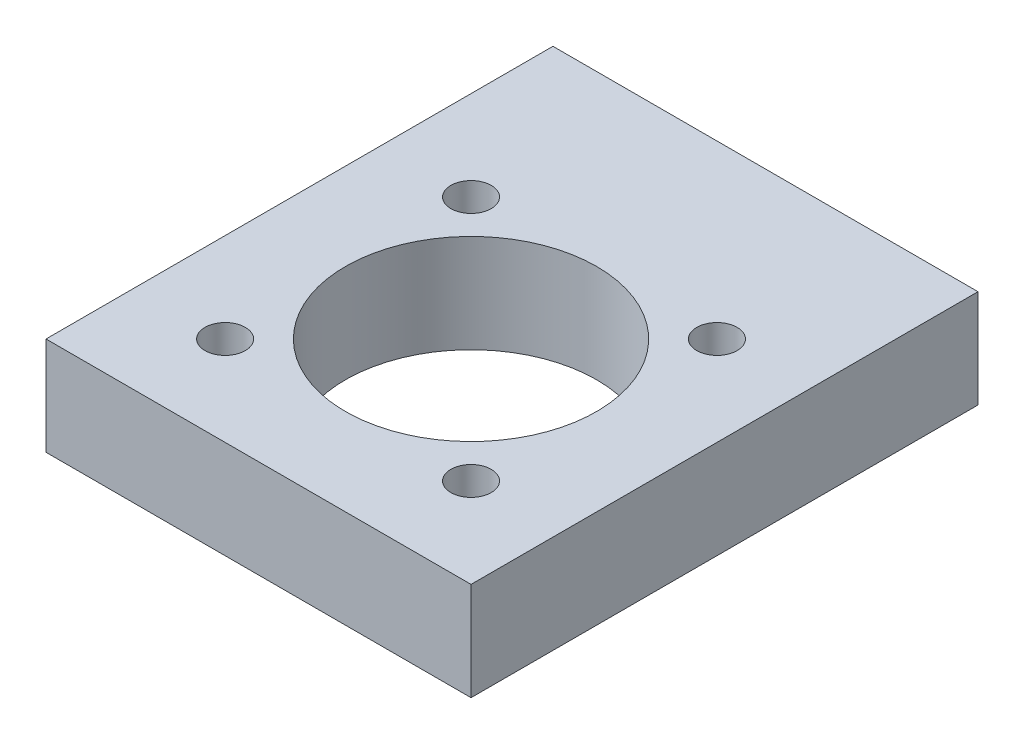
ISO-10303-21;
HEADER;
FILE_DESCRIPTION(('STEP AP214'),'2;1');
FILE_NAME('part.step','',(''),(''),'','','');
FILE_SCHEMA(('AUTOMOTIVE_DESIGN { 1 0 10303 214 1 1 1 1 }'));
ENDSEC;
DATA;
#1=APPLICATION_CONTEXT('core data for automotive mechanical design processes');
#2=APPLICATION_PROTOCOL_DEFINITION('international standard','automotive_design',2000,#1);
#3=PRODUCT_CONTEXT('',#1,'mechanical');
#4=PRODUCT('Part','Part','',(#3));
#5=PRODUCT_RELATED_PRODUCT_CATEGORY('part','',(#4));
#6=PRODUCT_DEFINITION_FORMATION('','',#4);
#7=PRODUCT_DEFINITION_CONTEXT('part definition',#1,'design');
#8=PRODUCT_DEFINITION('design','',#6,#7);
#9=PRODUCT_DEFINITION_SHAPE('','',#8);
#10=(LENGTH_UNIT() NAMED_UNIT(*) SI_UNIT(.MILLI.,.METRE.));
#11=(NAMED_UNIT(*) PLANE_ANGLE_UNIT() SI_UNIT($,.RADIAN.));
#12=(NAMED_UNIT(*) SI_UNIT($,.STERADIAN.) SOLID_ANGLE_UNIT());
#13=UNCERTAINTY_MEASURE_WITH_UNIT(LENGTH_MEASURE(1.E-05),#10,'distance_accuracy_value','');
#14=(GEOMETRIC_REPRESENTATION_CONTEXT(3) GLOBAL_UNCERTAINTY_ASSIGNED_CONTEXT((#13)) GLOBAL_UNIT_ASSIGNED_CONTEXT((#10,
#11,#12)) REPRESENTATION_CONTEXT('',''));
#15=CARTESIAN_POINT('',(0.,0.,0.));
#16=DIRECTION('',(0.,0.,1.));
#17=DIRECTION('',(1.,0.,0.));
#18=AXIS2_PLACEMENT_3D('',#15,#16,#17);
#19=CARTESIAN_POINT('',(-27.5,12.7,27.5));
#20=DIRECTION('',(0.,0.,-1.));
#21=DIRECTION('',(-1.,0.,0.));
#22=AXIS2_PLACEMENT_3D('',#19,#20,#21);
#23=PLANE('',#22);
#24=DIRECTION('',(1.,0.,0.));
#25=VECTOR('',#24,1.);
#26=CARTESIAN_POINT('',(-27.5,0.,27.5));
#27=LINE('',#26,#25);
#28=CARTESIAN_POINT('',(-27.5,0.,27.5));
#29=VERTEX_POINT('',#28);
#30=CARTESIAN_POINT('',(27.5,0.,27.5));
#31=VERTEX_POINT('',#30);
#32=EDGE_CURVE('E91',#29,#31,#27,.T.);
#33=ORIENTED_EDGE('',*,*,#32,.T.);
#34=DIRECTION('',(0.,-1.,0.));
#35=VECTOR('',#34,1.);
#36=CARTESIAN_POINT('',(27.5,12.7,27.5));
#37=LINE('',#36,#35);
#38=CARTESIAN_POINT('',(27.5,12.7,27.5));
#39=VERTEX_POINT('',#38);
#40=EDGE_CURVE('E45',#39,#31,#37,.T.);
#41=ORIENTED_EDGE('',*,*,#40,.F.);
#42=DIRECTION('',(1.,0.,0.));
#43=VECTOR('',#42,1.);
#44=CARTESIAN_POINT('',(-27.5,12.7,27.5));
#45=LINE('',#44,#43);
#46=CARTESIAN_POINT('',(-27.5,12.7,27.5));
#47=VERTEX_POINT('',#46);
#48=EDGE_CURVE('E83',#47,#39,#45,.T.);
#49=ORIENTED_EDGE('',*,*,#48,.F.);
#50=DIRECTION('',(0.,-1.,0.));
#51=VECTOR('',#50,1.);
#52=CARTESIAN_POINT('',(-27.5,12.7,27.5));
#53=LINE('',#52,#51);
#54=EDGE_CURVE('E11',#47,#29,#53,.T.);
#55=ORIENTED_EDGE('',*,*,#54,.T.);
#56=EDGE_LOOP('',(#33,#41,#49,#55));
#57=FACE_BOUND('',#56,.T.);
#58=ADVANCED_FACE('F37',(#57),#23,.F.);
#59=CARTESIAN_POINT('',(27.5,12.7,0.));
#60=DIRECTION('',(-1.,0.,0.));
#61=DIRECTION('',(0.,0.,1.));
#62=AXIS2_PLACEMENT_3D('',#59,#60,#61);
#63=PLANE('',#62);
#64=DIRECTION('',(0.,0.,-1.));
#65=VECTOR('',#64,1.);
#66=CARTESIAN_POINT('',(27.5,0.,0.));
#67=LINE('',#66,#65);
#68=CARTESIAN_POINT('',(27.5,0.,-38.1));
#69=VERTEX_POINT('',#68);
#70=EDGE_CURVE('E70',#31,#69,#67,.T.);
#71=ORIENTED_EDGE('',*,*,#70,.T.);
#72=DIRECTION('',(0.,-1.,0.));
#73=VECTOR('',#72,1.);
#74=CARTESIAN_POINT('',(27.5,12.7,-38.1));
#75=LINE('',#74,#73);
#76=CARTESIAN_POINT('',(27.5,12.7,-38.1));
#77=VERTEX_POINT('',#76);
#78=EDGE_CURVE('E92',#77,#69,#75,.T.);
#79=ORIENTED_EDGE('',*,*,#78,.F.);
#80=DIRECTION('',(0.,0.,-1.));
#81=VECTOR('',#80,1.);
#82=CARTESIAN_POINT('',(27.5,12.7,0.));
#83=LINE('',#82,#81);
#84=EDGE_CURVE('E87',#39,#77,#83,.T.);
#85=ORIENTED_EDGE('',*,*,#84,.F.);
#86=ORIENTED_EDGE('',*,*,#40,.T.);
#87=EDGE_LOOP('',(#71,#79,#85,#86));
#88=FACE_BOUND('',#87,.T.);
#89=ADVANCED_FACE('F93',(#88),#63,.F.);
#90=CARTESIAN_POINT('',(-27.5,12.7,-38.1));
#91=DIRECTION('',(0.,0.,1.));
#92=DIRECTION('',(1.,0.,0.));
#93=AXIS2_PLACEMENT_3D('',#90,#91,#92);
#94=PLANE('',#93);
#95=CARTESIAN_POINT('',(19.05,6.35,-38.1));
#96=DIRECTION('',(0.,0.,-1.));
#97=DIRECTION('',(1.,0.,0.));
#98=AXIS2_PLACEMENT_3D('',#95,#96,#97);
#99=CIRCLE('',#98,1.89865);
#100=CARTESIAN_POINT('',(20.94865,6.35,-38.1));
#101=VERTEX_POINT('',#100);
#102=EDGE_CURVE('E305',#101,#101,#99,.T.);
#103=ORIENTED_EDGE('',*,*,#102,.F.);
#104=EDGE_LOOP('',(#103));
#105=FACE_BOUND('',#104,.T.);
#106=CARTESIAN_POINT('',(-6.35,6.35,-38.1));
#107=DIRECTION('',(0.,0.,-1.));
#108=DIRECTION('',(-1.,0.,0.));
#109=AXIS2_PLACEMENT_3D('',#106,#107,#108);
#110=CIRCLE('',#109,1.89865);
#111=CARTESIAN_POINT('',(-8.24865,6.35,-38.1));
#112=VERTEX_POINT('',#111);
#113=EDGE_CURVE('E299',#112,#112,#110,.T.);
#114=ORIENTED_EDGE('',*,*,#113,.F.);
#115=EDGE_LOOP('',(#114));
#116=FACE_BOUND('',#115,.T.);
#117=CARTESIAN_POINT('',(-19.05,6.35,-38.1));
#118=DIRECTION('',(0.,0.,-1.));
#119=DIRECTION('',(-1.,0.,0.));
#120=AXIS2_PLACEMENT_3D('',#117,#118,#119);
#121=CIRCLE('',#120,1.89865);
#122=CARTESIAN_POINT('',(-20.94865,6.35,-38.1));
#123=VERTEX_POINT('',#122);
#124=EDGE_CURVE('E293',#123,#123,#121,.T.);
#125=ORIENTED_EDGE('',*,*,#124,.F.);
#126=EDGE_LOOP('',(#125));
#127=FACE_BOUND('',#126,.T.);
#128=CARTESIAN_POINT('',(6.35,6.35,-38.1));
#129=DIRECTION('',(0.,0.,-1.));
#130=DIRECTION('',(1.,0.,0.));
#131=AXIS2_PLACEMENT_3D('',#128,#129,#130);
#132=CIRCLE('',#131,1.89865);
#133=CARTESIAN_POINT('',(8.24865,6.35,-38.1));
#134=VERTEX_POINT('',#133);
#135=EDGE_CURVE('E287',#134,#134,#132,.T.);
#136=ORIENTED_EDGE('',*,*,#135,.F.);
#137=EDGE_LOOP('',(#136));
#138=FACE_BOUND('',#137,.T.);
#139=DIRECTION('',(-1.,0.,0.));
#140=VECTOR('',#139,1.);
#141=CARTESIAN_POINT('',(-27.5,0.,-38.1));
#142=LINE('',#141,#140);
#143=CARTESIAN_POINT('',(-27.5,0.,-38.1));
#144=VERTEX_POINT('',#143);
#145=EDGE_CURVE('E77',#69,#144,#142,.T.);
#146=ORIENTED_EDGE('',*,*,#145,.T.);
#147=DIRECTION('',(0.,-1.,0.));
#148=VECTOR('',#147,1.);
#149=CARTESIAN_POINT('',(-27.5,12.7,-38.1));
#150=LINE('',#149,#148);
#151=CARTESIAN_POINT('',(-27.5,12.7,-38.1));
#152=VERTEX_POINT('',#151);
#153=EDGE_CURVE('E97',#152,#144,#150,.T.);
#154=ORIENTED_EDGE('',*,*,#153,.F.);
#155=DIRECTION('',(-1.,0.,0.));
#156=VECTOR('',#155,1.);
#157=CARTESIAN_POINT('',(-27.5,12.7,-38.1));
#158=LINE('',#157,#156);
#159=EDGE_CURVE('E95',#77,#152,#158,.T.);
#160=ORIENTED_EDGE('',*,*,#159,.F.);
#161=ORIENTED_EDGE('',*,*,#78,.T.);
#162=EDGE_LOOP('',(#146,#154,#160,#161));
#163=FACE_BOUND('',#162,.T.);
#164=ADVANCED_FACE('F108',(#105,#116,#127,#138,#163),#94,.F.);
#165=CARTESIAN_POINT('',(-27.5,12.7,0.));
#166=DIRECTION('',(1.,0.,0.));
#167=DIRECTION('',(0.,0.,-1.));
#168=AXIS2_PLACEMENT_3D('',#165,#166,#167);
#169=PLANE('',#168);
#170=DIRECTION('',(0.,0.,1.));
#171=VECTOR('',#170,1.);
#172=CARTESIAN_POINT('',(-27.5,0.,0.));
#173=LINE('',#172,#171);
#174=EDGE_CURVE('E105',#144,#29,#173,.T.);
#175=ORIENTED_EDGE('',*,*,#174,.T.);
#176=ORIENTED_EDGE('',*,*,#54,.F.);
#177=DIRECTION('',(0.,0.,1.));
#178=VECTOR('',#177,1.);
#179=CARTESIAN_POINT('',(-27.5,12.7,27.5));
#180=LINE('',#179,#178);
#181=EDGE_CURVE('E53',#152,#47,#180,.T.);
#182=ORIENTED_EDGE('',*,*,#181,.F.);
#183=ORIENTED_EDGE('',*,*,#153,.T.);
#184=EDGE_LOOP('',(#175,#176,#182,#183));
#185=FACE_BOUND('',#184,.T.);
#186=ADVANCED_FACE('F112',(#185),#169,.F.);
#187=CARTESIAN_POINT('',(0.,12.7,0.));
#188=DIRECTION('',(0.,-1.,0.));
#189=DIRECTION('',(0.,0.,-1.));
#190=AXIS2_PLACEMENT_3D('',#187,#188,#189);
#191=PLANE('',#190);
#192=CARTESIAN_POINT('',(0.,12.7,0.));
#193=DIRECTION('',(0.,-1.,0.));
#194=DIRECTION('',(0.,0.,-1.));
#195=AXIS2_PLACEMENT_3D('',#192,#193,#194);
#196=CIRCLE('',#195,16.256);
#197=CARTESIAN_POINT('',(0.,12.7,-16.256));
#198=VERTEX_POINT('',#197);
#199=EDGE_CURVE('E281',#198,#198,#196,.F.);
#200=ORIENTED_EDGE('',*,*,#199,.F.);
#201=EDGE_LOOP('',(#200));
#202=FACE_BOUND('',#201,.T.);
#203=CARTESIAN_POINT('',(-15.9099025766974,12.7,-15.9099025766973));
#204=DIRECTION('',(0.,-1.,0.));
#205=DIRECTION('',(0.,0.,-1.));
#206=AXIS2_PLACEMENT_3D('',#203,#204,#205);
#207=CIRCLE('',#206,2.60985);
#208=CARTESIAN_POINT('',(-15.9099025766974,12.7,-18.5197525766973));
#209=VERTEX_POINT('',#208);
#210=EDGE_CURVE('E274',#209,#209,#207,.T.);
#211=ORIENTED_EDGE('',*,*,#210,.T.);
#212=EDGE_LOOP('',(#211));
#213=FACE_BOUND('',#212,.T.);
#214=CARTESIAN_POINT('',(15.9099025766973,12.7,15.9099025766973));
#215=DIRECTION('',(0.,-1.,0.));
#216=DIRECTION('',(0.,0.,-1.));
#217=AXIS2_PLACEMENT_3D('',#214,#215,#216);
#218=CIRCLE('',#217,2.60985);
#219=CARTESIAN_POINT('',(15.9099025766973,12.7,13.3000525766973));
#220=VERTEX_POINT('',#219);
#221=EDGE_CURVE('E270',#220,#220,#218,.T.);
#222=ORIENTED_EDGE('',*,*,#221,.T.);
#223=EDGE_LOOP('',(#222));
#224=FACE_BOUND('',#223,.T.);
#225=CARTESIAN_POINT('',(-15.9099025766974,12.7,15.9099025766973));
#226=DIRECTION('',(0.,-1.,0.));
#227=DIRECTION('',(0.,0.,-1.));
#228=AXIS2_PLACEMENT_3D('',#225,#226,#227);
#229=CIRCLE('',#228,2.60985);
#230=CARTESIAN_POINT('',(-15.9099025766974,12.7,13.3000525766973));
#231=VERTEX_POINT('',#230);
#232=EDGE_CURVE('E278',#231,#231,#229,.T.);
#233=ORIENTED_EDGE('',*,*,#232,.T.);
#234=EDGE_LOOP('',(#233));
#235=FACE_BOUND('',#234,.T.);
#236=CARTESIAN_POINT('',(15.9099025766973,12.7,-15.9099025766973));
#237=DIRECTION('',(0.,-1.,0.));
#238=DIRECTION('',(0.,0.,-1.));
#239=AXIS2_PLACEMENT_3D('',#236,#237,#238);
#240=CIRCLE('',#239,2.60985);
#241=CARTESIAN_POINT('',(15.9099025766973,12.7,-18.5197525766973));
#242=VERTEX_POINT('',#241);
#243=EDGE_CURVE('E265',#242,#242,#240,.T.);
#244=ORIENTED_EDGE('',*,*,#243,.T.);
#245=EDGE_LOOP('',(#244));
#246=FACE_BOUND('',#245,.T.);
#247=ORIENTED_EDGE('',*,*,#181,.T.);
#248=ORIENTED_EDGE('',*,*,#48,.T.);
#249=ORIENTED_EDGE('',*,*,#84,.T.);
#250=ORIENTED_EDGE('',*,*,#159,.T.);
#251=EDGE_LOOP('',(#247,#248,#249,#250));
#252=FACE_BOUND('',#251,.T.);
#253=ADVANCED_FACE('F85',(#202,#213,#224,#235,#246,#252),#191,.F.);
#254=CARTESIAN_POINT('',(0.,0.,0.));
#255=DIRECTION('',(0.,-1.,0.));
#256=DIRECTION('',(0.,0.,-1.));
#257=AXIS2_PLACEMENT_3D('',#254,#255,#256);
#258=PLANE('',#257);
#259=CARTESIAN_POINT('',(0.,0.,0.));
#260=DIRECTION('',(0.,-1.,0.));
#261=DIRECTION('',(0.,0.,-1.));
#262=AXIS2_PLACEMENT_3D('',#259,#260,#261);
#263=CIRCLE('',#262,16.256);
#264=CARTESIAN_POINT('',(0.,0.,-16.256));
#265=VERTEX_POINT('',#264);
#266=EDGE_CURVE('E250',#265,#265,#263,.T.);
#267=ORIENTED_EDGE('',*,*,#266,.F.);
#268=EDGE_LOOP('',(#267));
#269=FACE_BOUND('',#268,.T.);
#270=CARTESIAN_POINT('',(-15.9099025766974,0.,-15.9099025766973));
#271=DIRECTION('',(0.,1.,0.));
#272=DIRECTION('',(0.,0.,1.));
#273=AXIS2_PLACEMENT_3D('',#270,#271,#272);
#274=CIRCLE('',#273,2.60985);
#275=CARTESIAN_POINT('',(-15.9099025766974,0.,-13.3000525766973));
#276=VERTEX_POINT('',#275);
#277=EDGE_CURVE('E254',#276,#276,#274,.T.);
#278=ORIENTED_EDGE('',*,*,#277,.T.);
#279=EDGE_LOOP('',(#278));
#280=FACE_BOUND('',#279,.T.);
#281=CARTESIAN_POINT('',(15.9099025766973,0.,15.9099025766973));
#282=DIRECTION('',(0.,1.,0.));
#283=DIRECTION('',(0.,0.,-1.));
#284=AXIS2_PLACEMENT_3D('',#281,#282,#283);
#285=CIRCLE('',#284,2.60985);
#286=CARTESIAN_POINT('',(15.9099025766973,0.,13.3000525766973));
#287=VERTEX_POINT('',#286);
#288=EDGE_CURVE('E258',#287,#287,#285,.T.);
#289=ORIENTED_EDGE('',*,*,#288,.T.);
#290=EDGE_LOOP('',(#289));
#291=FACE_BOUND('',#290,.T.);
#292=CARTESIAN_POINT('',(-15.9099025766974,0.,15.9099025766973));
#293=DIRECTION('',(0.,1.,0.));
#294=DIRECTION('',(0.,0.,-1.));
#295=AXIS2_PLACEMENT_3D('',#292,#293,#294);
#296=CIRCLE('',#295,2.60985);
#297=CARTESIAN_POINT('',(-15.9099025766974,0.,13.3000525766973));
#298=VERTEX_POINT('',#297);
#299=EDGE_CURVE('E262',#298,#298,#296,.T.);
#300=ORIENTED_EDGE('',*,*,#299,.T.);
#301=EDGE_LOOP('',(#300));
#302=FACE_BOUND('',#301,.T.);
#303=CARTESIAN_POINT('',(15.9099025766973,0.,-15.9099025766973));
#304=DIRECTION('',(0.,1.,0.));
#305=DIRECTION('',(0.,0.,1.));
#306=AXIS2_PLACEMENT_3D('',#303,#304,#305);
#307=CIRCLE('',#306,2.60985);
#308=CARTESIAN_POINT('',(15.9099025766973,0.,-13.3000525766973));
#309=VERTEX_POINT('',#308);
#310=EDGE_CURVE('E102',#309,#309,#307,.T.);
#311=ORIENTED_EDGE('',*,*,#310,.T.);
#312=EDGE_LOOP('',(#311));
#313=FACE_BOUND('',#312,.T.);
#314=ORIENTED_EDGE('',*,*,#32,.F.);
#315=ORIENTED_EDGE('',*,*,#174,.F.);
#316=ORIENTED_EDGE('',*,*,#145,.F.);
#317=ORIENTED_EDGE('',*,*,#70,.F.);
#318=EDGE_LOOP('',(#314,#315,#316,#317));
#319=FACE_BOUND('',#318,.T.);
#320=ADVANCED_FACE('F111',(#269,#280,#291,#302,#313,#319),#258,.T.);
#321=CARTESIAN_POINT('',(15.9099025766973,12.701,-15.9099025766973));
#322=DIRECTION('',(0.,-1.,0.));
#323=DIRECTION('',(0.,0.,-1.));
#324=AXIS2_PLACEMENT_3D('',#321,#322,#323);
#325=CYLINDRICAL_SURFACE('',#324,2.60985);
#326=ORIENTED_EDGE('',*,*,#310,.F.);
#327=EDGE_LOOP('',(#326));
#328=FACE_BOUND('',#327,.T.);
#329=ORIENTED_EDGE('',*,*,#243,.F.);
#330=EDGE_LOOP('',(#329));
#331=FACE_BOUND('',#330,.T.);
#332=ADVANCED_FACE('F234',(#328,#331),#325,.F.);
#333=CARTESIAN_POINT('',(-15.9099025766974,12.701,15.9099025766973));
#334=DIRECTION('',(0.,-1.,0.));
#335=DIRECTION('',(0.,0.,-1.));
#336=AXIS2_PLACEMENT_3D('',#333,#334,#335);
#337=CYLINDRICAL_SURFACE('',#336,2.60985);
#338=ORIENTED_EDGE('',*,*,#299,.F.);
#339=EDGE_LOOP('',(#338));
#340=FACE_BOUND('',#339,.T.);
#341=ORIENTED_EDGE('',*,*,#232,.F.);
#342=EDGE_LOOP('',(#341));
#343=FACE_BOUND('',#342,.T.);
#344=ADVANCED_FACE('F230',(#340,#343),#337,.F.);
#345=CARTESIAN_POINT('',(15.9099025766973,12.701,15.9099025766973));
#346=DIRECTION('',(0.,-1.,0.));
#347=DIRECTION('',(0.,0.,-1.));
#348=AXIS2_PLACEMENT_3D('',#345,#346,#347);
#349=CYLINDRICAL_SURFACE('',#348,2.60985);
#350=ORIENTED_EDGE('',*,*,#288,.F.);
#351=EDGE_LOOP('',(#350));
#352=FACE_BOUND('',#351,.T.);
#353=ORIENTED_EDGE('',*,*,#221,.F.);
#354=EDGE_LOOP('',(#353));
#355=FACE_BOUND('',#354,.T.);
#356=ADVANCED_FACE('F233',(#352,#355),#349,.F.);
#357=CARTESIAN_POINT('',(-15.9099025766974,12.701,-15.9099025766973));
#358=DIRECTION('',(0.,-1.,0.));
#359=DIRECTION('',(0.,0.,-1.));
#360=AXIS2_PLACEMENT_3D('',#357,#358,#359);
#361=CYLINDRICAL_SURFACE('',#360,2.60985);
#362=ORIENTED_EDGE('',*,*,#277,.F.);
#363=EDGE_LOOP('',(#362));
#364=FACE_BOUND('',#363,.T.);
#365=ORIENTED_EDGE('',*,*,#210,.F.);
#366=EDGE_LOOP('',(#365));
#367=FACE_BOUND('',#366,.T.);
#368=ADVANCED_FACE('F228',(#364,#367),#361,.F.);
#369=CARTESIAN_POINT('',(0.,12.701,0.));
#370=DIRECTION('',(0.,-1.,0.));
#371=DIRECTION('',(0.,0.,-1.));
#372=AXIS2_PLACEMENT_3D('',#369,#370,#371);
#373=CYLINDRICAL_SURFACE('',#372,16.256);
#374=ORIENTED_EDGE('',*,*,#266,.T.);
#375=EDGE_LOOP('',(#374));
#376=FACE_BOUND('',#375,.T.);
#377=ORIENTED_EDGE('',*,*,#199,.T.);
#378=EDGE_LOOP('',(#377));
#379=FACE_BOUND('',#378,.T.);
#380=ADVANCED_FACE('F141',(#376,#379),#373,.F.);
#381=CARTESIAN_POINT('',(6.35,6.35,-25.4));
#382=DIRECTION('',(0.,0.,-1.));
#383=DIRECTION('',(-1.,0.,0.));
#384=AXIS2_PLACEMENT_3D('',#381,#382,#383);
#385=CYLINDRICAL_SURFACE('',#384,1.89865);
#386=CARTESIAN_POINT('',(6.35,6.35,-25.4));
#387=DIRECTION('',(0.,0.,-1.));
#388=DIRECTION('',(1.,0.,0.));
#389=AXIS2_PLACEMENT_3D('',#386,#387,#388);
#390=CIRCLE('',#389,1.89865);
#391=CARTESIAN_POINT('',(8.24865,6.35,-25.4));
#392=VERTEX_POINT('',#391);
#393=EDGE_CURVE('E290',#392,#392,#390,.T.);
#394=ORIENTED_EDGE('',*,*,#393,.F.);
#395=EDGE_LOOP('',(#394));
#396=FACE_BOUND('',#395,.T.);
#397=ORIENTED_EDGE('',*,*,#135,.T.);
#398=EDGE_LOOP('',(#397));
#399=FACE_BOUND('',#398,.T.);
#400=ADVANCED_FACE('F146',(#396,#399),#385,.F.);
#401=CARTESIAN_POINT('',(6.35,6.35,-25.4));
#402=DIRECTION('',(0.,0.,1.));
#403=DIRECTION('',(1.,0.,0.));
#404=AXIS2_PLACEMENT_3D('',#401,#402,#403);
#405=PLANE('',#404);
#406=ORIENTED_EDGE('',*,*,#393,.T.);
#407=EDGE_LOOP('',(#406));
#408=FACE_BOUND('',#407,.T.);
#409=ADVANCED_FACE('F151',(#408),#405,.F.);
#410=CARTESIAN_POINT('',(-19.05,6.35,-25.4));
#411=DIRECTION('',(0.,0.,-1.));
#412=DIRECTION('',(-1.,0.,0.));
#413=AXIS2_PLACEMENT_3D('',#410,#411,#412);
#414=CYLINDRICAL_SURFACE('',#413,1.89865);
#415=CARTESIAN_POINT('',(-19.05,6.35,-25.4));
#416=DIRECTION('',(0.,0.,-1.));
#417=DIRECTION('',(-1.,0.,0.));
#418=AXIS2_PLACEMENT_3D('',#415,#416,#417);
#419=CIRCLE('',#418,1.89865);
#420=CARTESIAN_POINT('',(-20.94865,6.35,-25.4));
#421=VERTEX_POINT('',#420);
#422=EDGE_CURVE('E296',#421,#421,#419,.T.);
#423=ORIENTED_EDGE('',*,*,#422,.F.);
#424=EDGE_LOOP('',(#423));
#425=FACE_BOUND('',#424,.T.);
#426=ORIENTED_EDGE('',*,*,#124,.T.);
#427=EDGE_LOOP('',(#426));
#428=FACE_BOUND('',#427,.T.);
#429=ADVANCED_FACE('F161',(#425,#428),#414,.F.);
#430=CARTESIAN_POINT('',(-19.05,6.35,-25.4));
#431=DIRECTION('',(0.,0.,-1.));
#432=DIRECTION('',(-1.,0.,0.));
#433=AXIS2_PLACEMENT_3D('',#430,#431,#432);
#434=PLANE('',#433);
#435=ORIENTED_EDGE('',*,*,#422,.T.);
#436=EDGE_LOOP('',(#435));
#437=FACE_BOUND('',#436,.T.);
#438=ADVANCED_FACE('F171',(#437),#434,.T.);
#439=CARTESIAN_POINT('',(-6.35,6.35,-25.4));
#440=DIRECTION('',(0.,0.,-1.));
#441=DIRECTION('',(-1.,0.,0.));
#442=AXIS2_PLACEMENT_3D('',#439,#440,#441);
#443=CYLINDRICAL_SURFACE('',#442,1.89865);
#444=CARTESIAN_POINT('',(-6.35,6.35,-25.4));
#445=DIRECTION('',(0.,0.,-1.));
#446=DIRECTION('',(-1.,0.,0.));
#447=AXIS2_PLACEMENT_3D('',#444,#445,#446);
#448=CIRCLE('',#447,1.89865);
#449=CARTESIAN_POINT('',(-8.24865,6.35,-25.4));
#450=VERTEX_POINT('',#449);
#451=EDGE_CURVE('E302',#450,#450,#448,.T.);
#452=ORIENTED_EDGE('',*,*,#451,.F.);
#453=EDGE_LOOP('',(#452));
#454=FACE_BOUND('',#453,.T.);
#455=ORIENTED_EDGE('',*,*,#113,.T.);
#456=EDGE_LOOP('',(#455));
#457=FACE_BOUND('',#456,.T.);
#458=ADVANCED_FACE('F181',(#454,#457),#443,.F.);
#459=CARTESIAN_POINT('',(-6.35,6.35,-25.4));
#460=DIRECTION('',(0.,0.,-1.));
#461=DIRECTION('',(-1.,0.,0.));
#462=AXIS2_PLACEMENT_3D('',#459,#460,#461);
#463=PLANE('',#462);
#464=ORIENTED_EDGE('',*,*,#451,.T.);
#465=EDGE_LOOP('',(#464));
#466=FACE_BOUND('',#465,.T.);
#467=ADVANCED_FACE('F191',(#466),#463,.T.);
#468=CARTESIAN_POINT('',(19.05,6.35,-25.4));
#469=DIRECTION('',(0.,0.,-1.));
#470=DIRECTION('',(-1.,0.,0.));
#471=AXIS2_PLACEMENT_3D('',#468,#469,#470);
#472=CYLINDRICAL_SURFACE('',#471,1.89865);
#473=CARTESIAN_POINT('',(19.05,6.35,-25.4));
#474=DIRECTION('',(0.,0.,-1.));
#475=DIRECTION('',(1.,0.,0.));
#476=AXIS2_PLACEMENT_3D('',#473,#474,#475);
#477=CIRCLE('',#476,1.89865);
#478=CARTESIAN_POINT('',(20.94865,6.35,-25.4));
#479=VERTEX_POINT('',#478);
#480=EDGE_CURVE('E286',#479,#479,#477,.T.);
#481=ORIENTED_EDGE('',*,*,#480,.F.);
#482=EDGE_LOOP('',(#481));
#483=FACE_BOUND('',#482,.T.);
#484=ORIENTED_EDGE('',*,*,#102,.T.);
#485=EDGE_LOOP('',(#484));
#486=FACE_BOUND('',#485,.T.);
#487=ADVANCED_FACE('F201',(#483,#486),#472,.F.);
#488=CARTESIAN_POINT('',(19.05,6.35,-25.4));
#489=DIRECTION('',(0.,0.,1.));
#490=DIRECTION('',(1.,0.,0.));
#491=AXIS2_PLACEMENT_3D('',#488,#489,#490);
#492=PLANE('',#491);
#493=ORIENTED_EDGE('',*,*,#480,.T.);
#494=EDGE_LOOP('',(#493));
#495=FACE_BOUND('',#494,.T.);
#496=ADVANCED_FACE('F211',(#495),#492,.F.);
#497=CLOSED_SHELL('',(#58,#89,#164,#186,#253,#320,#332,#344,#356,#368,#380,#400,#409,#429,#438,
#458,#467,#487,#496));
#498=MANIFOLD_SOLID_BREP('B2',#497);
#499=ADVANCED_BREP_SHAPE_REPRESENTATION('',(#18,#498),#14);
#500=SHAPE_DEFINITION_REPRESENTATION(#9,#499);
ENDSEC;
END-ISO-10303-21;
